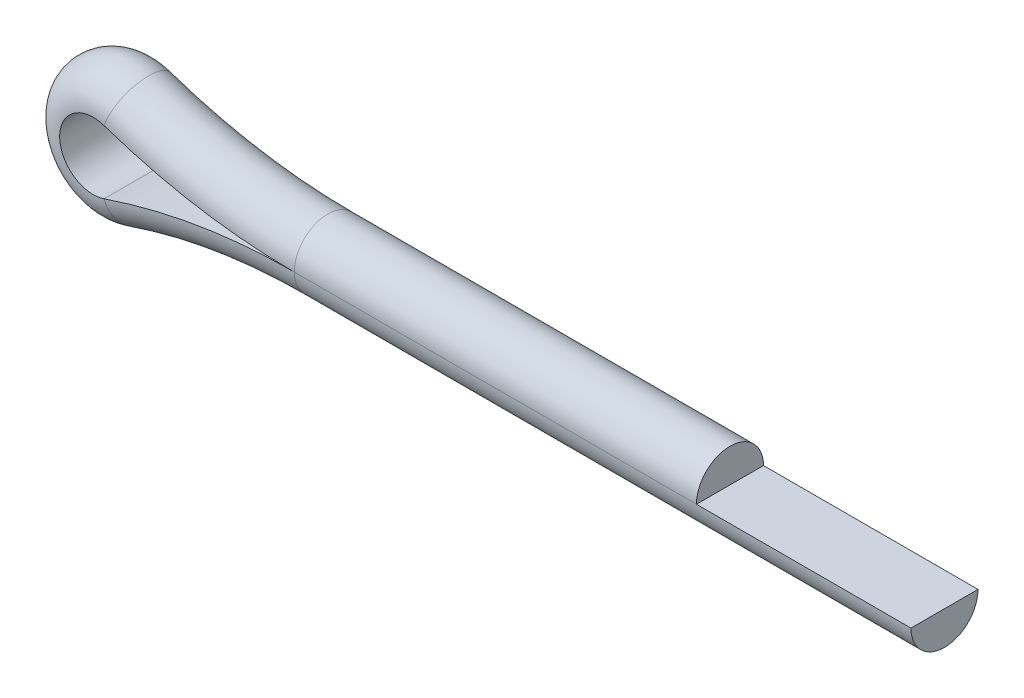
from build123d import *


with BuildPart() as part:
    # Body: sweep along a path in PathSke
    with BuildLine(Plane(origin=(1.207969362, 1.807969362, 0), x_dir=(0, 1, 0), z_dir=(0, 0, 1))) as body_path:
        Line((-1.557969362, -3.792030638), (-1.557969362, -0.792030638))
        ThreePointArc((-1.557969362, -0.792030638), (-1.501844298, -0.113884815), (-1.334996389, 0.5458072))
        ThreePointArc((-1.334996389, 0.5458072), (-1.807969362, 1.207969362), (-2.280942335, 0.5458072))
        ThreePointArc((-2.280942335, 0.5458072), (-2.114094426, -0.113884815), (-2.057969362, -0.792030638))
        Line((-2.057969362, -0.792030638), (-2.057969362, -5.392030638))
    # SectionSke → Body (sweep)
    with BuildSketch(Plane(origin=(5, 0.15, 0.15), x_dir=(0, 1, 0), z_dir=(1, 0, 0))):
        with BuildLine():
            Line((-0.15, -0.4), (-0.15, 0.1))
            ThreePointArc((-0.15, 0.1), (0.1, -0.15), (-0.15, -0.4))
        make_face()
    sweep(path=body_path.line)


solid = part.part
